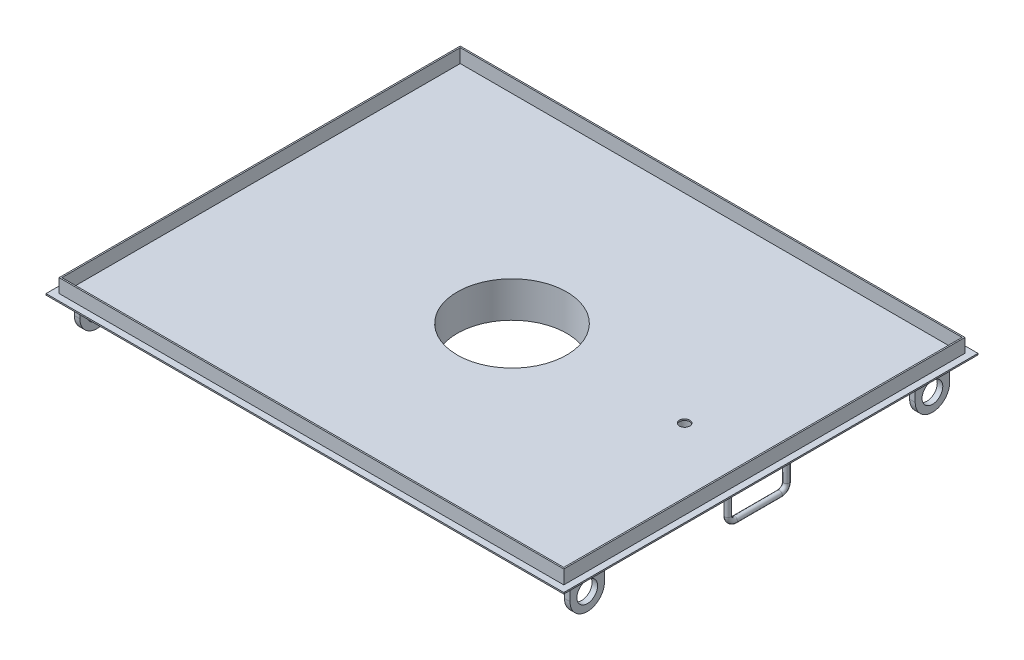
from build123d import *

# Parameters (mm, degrees)
SKETCH1_W               = 1500
SKETCH1_H               = 1200
SKETCH1_R               = 162.5
BOSS_EXTRUDE1_DEPTH     = 4
SKETCH2_W               = 1462
SKETCH2_H               = 1162
SKETCH2_W_2             = 1454
SKETCH2_H_2             = 1154
BOSS_EXTRUDE2_DEPTH     = 40
BOSS_EXTRUDE3_START     = -104
SKETCH3_R               = 162.5
SKETCH3_R_2             = 158.5
BOSS_EXTRUDE3_DEPTH     = 104
SKETCH4_R               = 202.5
SKETCH4_R_2             = 162.5
BOSS_EXTRUDE4_DEPTH     = 4
SKETCH5_R               = 35
SKETCH5_R_2             = 24
BOSS_EXTRUDE5_DEPTH     = 26
SKETCH6_R               = 15
CUT_EXTRUDE1_DEPTH      = 966.660395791
SKETCH7_R               = 128
BOSS_EXTRUDE6_DEPTH     = 57
SKETCH9_R               = 9
BOSS_EXTRUDE7_START     = -33
BOSS_EXTRUDE7_DEPTH     = 33
SKETCH12_W              = 23.5
SKETCH12_H              = 30
BOSS_EXTRUDE8_DEPTH     = 50
BOSS_EXTRUDE8_2_DEPTH   = 50
SKETCH17_R              = 30
BOSS_EXTRUDE9_DEPTH     = 8
MIRROR2_COPY_1_SKETCH_R = 30
MIRROR2_COPY_1_DEPTH    = 8
SKETCH21_R              = 8


with BuildPart() as part:
    # Sketch1 → Boss-Extrude1 (new body)
    with BuildSketch(Plane(origin=(0, 0, 0), x_dir=(1, 0, 0), z_dir=(0, 1, 0))):
        Rectangle(SKETCH1_W, SKETCH1_H)
        with Locations(Location((0, 0, 0), (0, 0, 270))):
            Circle(SKETCH1_R, mode=Mode.SUBTRACT)
    extrude(amount=BOSS_EXTRUDE1_DEPTH)

    # Sketch2 → Boss-Extrude2 (add)
    with BuildSketch(Plane(origin=(0, 4, 0), x_dir=(1, 0, 0), z_dir=(0, 1, 0))):
        Rectangle(SKETCH2_W, SKETCH2_H)
        Rectangle(SKETCH2_W_2, SKETCH2_H_2, mode=Mode.SUBTRACT)
    extrude(amount=BOSS_EXTRUDE2_DEPTH)

    # Sketch3 → Boss-Extrude3 (add)
    with BuildSketch(Plane(origin=(0, 4, 0), x_dir=(1, 0, 0), z_dir=(0, 1, 0)).offset(BOSS_EXTRUDE3_START)):
        with Locations(Location((0, 0, 0), (0, 0, 270))):
            Circle(SKETCH3_R)
        with Locations(Location((0, 0, 0), (0, 0, 270))):
            Circle(SKETCH3_R_2, mode=Mode.SUBTRACT)
    extrude(amount=BOSS_EXTRUDE3_DEPTH)

    # Sketch4 → Boss-Extrude4 (add)
    with BuildSketch(Plane.XZ.offset(100)):
        with Locations(Location((0, 0, 0), (0, 0, 270))):
            Circle(SKETCH4_R)
        with Locations(Location((0, 0, 0), (0, 0, 90))):
            Circle(SKETCH4_R_2, mode=Mode.SUBTRACT)
    extrude(amount=-BOSS_EXTRUDE4_DEPTH)

    # Sketch5 → Boss-Extrude5 (add)
    with BuildSketch(Plane.XZ):
        with Locations(Location((500, 0, 0), (0, 0, 90))):
            Circle(SKETCH5_R)
        with Locations(Location((500, 0, 0), (0, 0, 90))):
            Circle(SKETCH5_R_2, mode=Mode.SUBTRACT)
    extrude(amount=BOSS_EXTRUDE5_DEPTH)

    # Sketch6 → Cut-Extrude1 (cut, through all)
    with BuildSketch(Plane.XZ):
        with Locations(Location((500, 0, 0), (0, 0, 270))):
            Circle(SKETCH6_R)
    extrude(amount=-CUT_EXTRUDE1_DEPTH, mode=Mode.SUBTRACT)

    # Sketch7 → Boss-Extrude6 (add)
    with BuildSketch(Plane.XZ):
        with Locations(Location((-500, 0, 0), (0, 0, 90))):
            Circle(SKETCH7_R)
    extrude(amount=BOSS_EXTRUDE6_DEPTH)

    # Sweep1: sweep along a path in Sketch8
    with BuildLine(Plane.XY) as sweep1_path:
        Line((-575, -57), (-575, -126))
        ThreePointArc((-575, -126), (-569.142135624, -140.142135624), (-555, -146))
        Line((-555, -146), (-445, -146))
        ThreePointArc((-445, -146), (-430.857864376, -140.142135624), (-425, -126))
        Line((-425, -126), (-425, -57))
    # Sketch9 → Sweep1 (sweep)
    with BuildSketch(Plane.XZ.offset(57)):
        with Locations((-425, 0)):
            Circle(SKETCH9_R)
    sweep(path=sweep1_path.line)

    # Sweep2: sweep along a curve in space
    with BuildLine() as sweep2_path:
        ThreePointArc((-500, -57, -128), (-409.490332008, -57, -90.509667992), (-372, -57, 0))
        ThreePointArc((-372, -57, 0), (-409.490332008, -57, 90.509667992), (-500, -57, 128))
        ThreePointArc((-500, -57, 128), (-590.509667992, -57, 90.509667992), (-628, -57, 0))
        ThreePointArc((-628, -57, 0), (-590.509667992, -57, -90.509667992), (-500, -57, -128))
    # Sketch10 → Sweep2 (sweep)
    with BuildSketch(Plane.XY):
        with BuildLine():
            Line((-361, -44), (-372, -44))
            Line((-372, -44), (-372, -35))
            Line((-372, -35), (-352, -35))
            ThreePointArc((-352, -35), (-354.636038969, -41.363961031), (-361, -44))
        make_face()
        with BuildLine():
            Line((-372, -33), (-372, -24))
            Line((-372, -24), (-361, -24))
            ThreePointArc((-361, -24), (-354.636038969, -26.636038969), (-352, -33))
            Line((-352, -33), (-372, -33))
        make_face()
    sweep(path=sweep2_path.line)

    # Sketch11 → Boss-Extrude7 (add)
    with BuildSketch(Plane.XZ.offset(57).offset(BOSS_EXTRUDE7_START)):
        with BuildLine():
            Line((-540, -121.589473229), (-540, -175))
            Line((-540, -175), (-460, -175))
            Line((-460, -175), (-460, -121.589473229))
            ThreePointArc((-460, -121.589473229), (-500, -128), (-540, -121.589473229))
        make_face()
    extrude(amount=BOSS_EXTRUDE7_DEPTH)



with BuildPart() as body_2:
    # Sketch12 → Boss-Extrude8 (new body)
    with BuildSketch(Plane.XZ.offset(57)):
        with Locations((-513.25, 148)):
            Rectangle(SKETCH12_W, SKETCH12_H)
    extrude(amount=-BOSS_EXTRUDE8_DEPTH)


with BuildPart() as body_3:
    # Sketch12 → Boss-Extrude8 2 (new body)
    with BuildSketch(Plane.XZ.offset(57)):
        with Locations((-486.75, 148)):
            Rectangle(SKETCH12_W, SKETCH12_H)
    extrude(amount=-BOSS_EXTRUDE8_2_DEPTH)


with BuildPart() as part_1:
    add(part.part)

    add(body_2.part)  # Revolve1 merges body 2

    add(body_3.part)  # Revolve1 merges body 3
    # Sketch15 → Revolve1 (revolve)
    with BuildSketch(Plane(origin=(0, -32, 0), x_dir=(-1, 0, 0), z_dir=(0, -1, 0)), mode=Mode.PRIVATE) as revolve1_sk:
        Polygon((475, -148), (533.020180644, -148), (555, -140), (555, -153), (475, -153), align=None)
    revolve(revolve1_sk.sketch.rotate(Axis((-555, -32, 153), (1, 0, 0)), 180), axis=Axis((-555, -32, 153), (1, 0, 0)))

    # Sketch17 → Boss-Extrude9 (add, symmetric)
    with BuildSketch(Plane(origin=(710, 0, 0), x_dir=(0, 0, -1), z_dir=(1, 0, 0))):
        with BuildLine():
            Line((550, 0), (450, 0))
            Line((450, 0), (450, -60))
            ThreePointArc((450, -60), (500, -110), (550, -60))
            Line((550, -60), (550, 0))
        make_face()
        with Locations((500, -60)):
            Circle(SKETCH17_R, mode=Mode.SUBTRACT)
    boss_extrude9 = extrude(amount=BOSS_EXTRUDE9_DEPTH, both=True)

    # Mirror1: Boss-Extrude9 across plane
    add(boss_extrude9.mirror(Plane(origin=(0, 0, 0), x_dir=(0, 0, 1), z_dir=(1, 0, 0))))

    # Mirror2: Boss-Extrude9 across plane
    add(boss_extrude9.mirror(Plane.XY))

    # Mirror2 copy 1 sketch → Mirror2 copy 1 (add, symmetric)
    with BuildSketch(Plane.ZY.offset(710)):
        with BuildLine():
            Line((550, 0), (450, 0))
            Line((450, 0), (450, -60))
            ThreePointArc((450, -60), (500, -110), (550, -60))
            Line((550, -60), (550, 0))
        make_face()
        with Locations((500, -60)):
            Circle(MIRROR2_COPY_1_SKETCH_R, mode=Mode.SUBTRACT)
    extrude(amount=MIRROR2_COPY_1_DEPTH, both=True)

    # Sweep3: sweep along a path in Sketch20
    with BuildLine(Plane.ZY.offset(-710)) as sweep3_path:
        Line((-85, 0), (-85, -80))
        ThreePointArc((-85, -80), (-79.142135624, -94.142135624), (-65, -100))
        Line((-65, -100), (65, -100))
        ThreePointArc((65, -100), (79.142135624, -94.142135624), (85, -80))
        Line((85, -80), (85, 0))
    # Sketch21 → Sweep3 (sweep)
    with BuildSketch(Plane.XZ):
        with Locations((710, 85)):
            Circle(SKETCH21_R)
    sweep3 = sweep(path=sweep3_path.line)

    # Mirror3: Sweep3 across plane
    add(sweep3.mirror(Plane(origin=(0, 0, 0), x_dir=(0, 0, 1), z_dir=(1, 0, 0))))


solid = part_1.part
